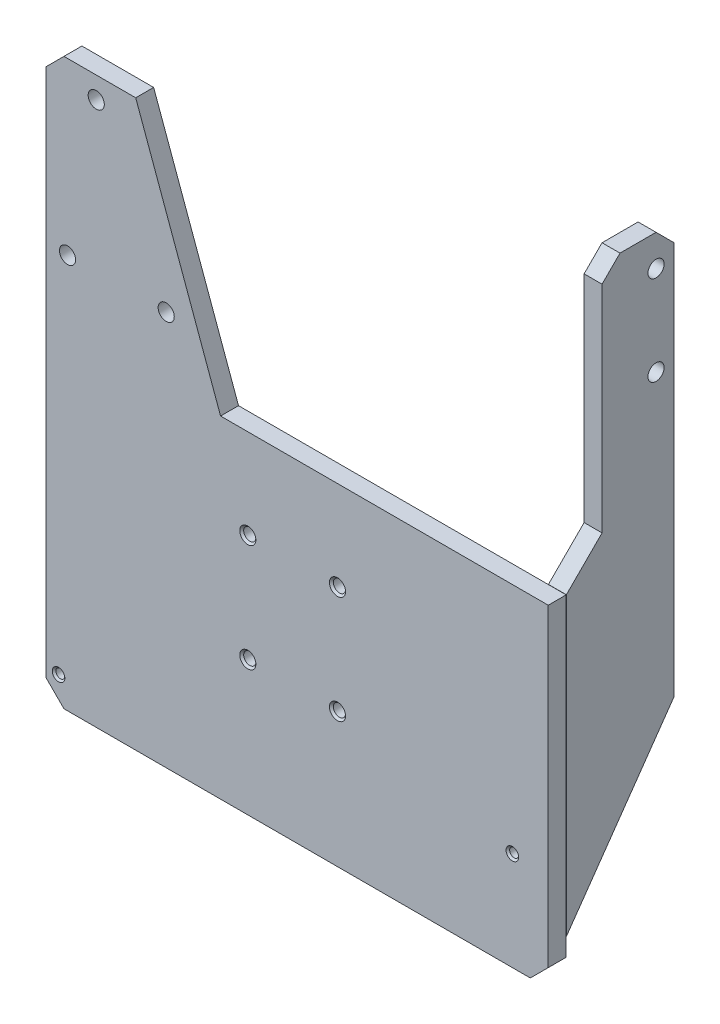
ISO-10303-21;
HEADER;
FILE_DESCRIPTION(('STEP AP214'),'2;1');
FILE_NAME('part.step','',(''),(''),'','','');
FILE_SCHEMA(('AUTOMOTIVE_DESIGN { 1 0 10303 214 1 1 1 1 }'));
ENDSEC;
DATA;
#1=APPLICATION_CONTEXT('core data for automotive mechanical design processes');
#2=APPLICATION_PROTOCOL_DEFINITION('international standard','automotive_design',2000,#1);
#3=PRODUCT_CONTEXT('',#1,'mechanical');
#4=PRODUCT('Part','Part','',(#3));
#5=PRODUCT_RELATED_PRODUCT_CATEGORY('part','',(#4));
#6=PRODUCT_DEFINITION_FORMATION('','',#4);
#7=PRODUCT_DEFINITION_CONTEXT('part definition',#1,'design');
#8=PRODUCT_DEFINITION('design','',#6,#7);
#9=PRODUCT_DEFINITION_SHAPE('','',#8);
#10=(LENGTH_UNIT() NAMED_UNIT(*) SI_UNIT(.MILLI.,.METRE.));
#11=(NAMED_UNIT(*) PLANE_ANGLE_UNIT() SI_UNIT($,.RADIAN.));
#12=(NAMED_UNIT(*) SI_UNIT($,.STERADIAN.) SOLID_ANGLE_UNIT());
#13=UNCERTAINTY_MEASURE_WITH_UNIT(LENGTH_MEASURE(1.E-05),#10,'distance_accuracy_value','');
#14=(GEOMETRIC_REPRESENTATION_CONTEXT(3) GLOBAL_UNCERTAINTY_ASSIGNED_CONTEXT((#13)) GLOBAL_UNIT_ASSIGNED_CONTEXT((#10,
#11,#12)) REPRESENTATION_CONTEXT('',''));
#15=CARTESIAN_POINT('',(0.,0.,0.));
#16=DIRECTION('',(0.,0.,1.));
#17=DIRECTION('',(1.,0.,0.));
#18=AXIS2_PLACEMENT_3D('',#15,#16,#17);
#19=CARTESIAN_POINT('',(125.,-25.,-0.10000000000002));
#20=DIRECTION('',(0.,-0.573576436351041,-0.819152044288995));
#21=DIRECTION('',(0.,0.819152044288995,-0.573576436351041));
#22=AXIS2_PLACEMENT_3D('',#19,#20,#21);
#23=PLANE('',#22);
#24=DIRECTION('',(0.,0.819152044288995,-0.573576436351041));
#25=VECTOR('',#24,1.);
#26=CARTESIAN_POINT('',(135.,-25.,-0.10000000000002));
#27=LINE('',#26,#25);
#28=CARTESIAN_POINT('',(135.,-25.,-0.10000000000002));
#29=VERTEX_POINT('',#28);
#30=CARTESIAN_POINT('',(135.,60.6888804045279,-60.1));
#31=VERTEX_POINT('',#30);
#32=EDGE_CURVE('E106',#29,#31,#27,.T.);
#33=ORIENTED_EDGE('',*,*,#32,.F.);
#34=DIRECTION('',(1.,0.,0.));
#35=VECTOR('',#34,1.);
#36=CARTESIAN_POINT('',(125.,-25.,-0.10000000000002));
#37=LINE('',#36,#35);
#38=CARTESIAN_POINT('',(125.,-25.,-0.10000000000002));
#39=VERTEX_POINT('',#38);
#40=EDGE_CURVE('E12',#39,#29,#37,.T.);
#41=ORIENTED_EDGE('',*,*,#40,.F.);
#42=DIRECTION('',(0.,0.819152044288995,-0.573576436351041));
#43=VECTOR('',#42,1.);
#44=CARTESIAN_POINT('',(125.,-25.,-0.10000000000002));
#45=LINE('',#44,#43);
#46=CARTESIAN_POINT('',(125.,60.6888804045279,-60.1));
#47=VERTEX_POINT('',#46);
#48=EDGE_CURVE('E108',#39,#47,#45,.T.);
#49=ORIENTED_EDGE('',*,*,#48,.T.);
#50=DIRECTION('',(1.,0.,0.));
#51=VECTOR('',#50,1.);
#52=CARTESIAN_POINT('',(125.,60.6888804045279,-60.1));
#53=LINE('',#52,#51);
#54=EDGE_CURVE('E45',#47,#31,#53,.T.);
#55=ORIENTED_EDGE('',*,*,#54,.T.);
#56=EDGE_LOOP('',(#33,#41,#49,#55));
#57=FACE_BOUND('',#56,.T.);
#58=ADVANCED_FACE('F42',(#57),#23,.T.);
#59=CARTESIAN_POINT('',(125.,140.,-0.1));
#60=DIRECTION('',(0.,0.,1.));
#61=DIRECTION('',(0.,-1.,0.));
#62=AXIS2_PLACEMENT_3D('',#59,#60,#61);
#63=PLANE('',#62);
#64=DIRECTION('',(0.,-1.,0.));
#65=VECTOR('',#64,1.);
#66=CARTESIAN_POINT('',(135.,140.,-0.1));
#67=LINE('',#66,#65);
#68=CARTESIAN_POINT('',(135.,140.,-0.1));
#69=VERTEX_POINT('',#68);
#70=EDGE_CURVE('E124',#69,#29,#67,.T.);
#71=ORIENTED_EDGE('',*,*,#70,.F.);
#72=DIRECTION('',(1.,0.,0.));
#73=VECTOR('',#72,1.);
#74=CARTESIAN_POINT('',(125.,140.,-0.1));
#75=LINE('',#74,#73);
#76=CARTESIAN_POINT('',(125.,140.,-0.1));
#77=VERTEX_POINT('',#76);
#78=EDGE_CURVE('E50',#77,#69,#75,.T.);
#79=ORIENTED_EDGE('',*,*,#78,.F.);
#80=DIRECTION('',(0.,-1.,0.));
#81=VECTOR('',#80,1.);
#82=CARTESIAN_POINT('',(125.,140.,-0.1));
#83=LINE('',#82,#81);
#84=EDGE_CURVE('E113',#77,#39,#83,.T.);
#85=ORIENTED_EDGE('',*,*,#84,.T.);
#86=ORIENTED_EDGE('',*,*,#40,.T.);
#87=EDGE_LOOP('',(#71,#79,#85,#86));
#88=FACE_BOUND('',#87,.T.);
#89=ADVANCED_FACE('F190',(#88),#63,.T.);
#90=CARTESIAN_POINT('',(125.,140.,-0.1));
#91=DIRECTION('',(0.,0.707106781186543,0.707106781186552));
#92=DIRECTION('',(0.,-0.707106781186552,0.707106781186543));
#93=AXIS2_PLACEMENT_3D('',#90,#91,#92);
#94=PLANE('',#93);
#95=DIRECTION('',(0.,-0.707106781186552,0.707106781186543));
#96=VECTOR('',#95,1.);
#97=CARTESIAN_POINT('',(135.,140.,-0.1));
#98=LINE('',#97,#96);
#99=CARTESIAN_POINT('',(135.,159.9,-20.));
#100=VERTEX_POINT('',#99);
#101=EDGE_CURVE('E142',#100,#69,#98,.T.);
#102=ORIENTED_EDGE('',*,*,#101,.F.);
#103=DIRECTION('',(1.,0.,0.));
#104=VECTOR('',#103,1.);
#105=CARTESIAN_POINT('',(125.,159.9,-20.));
#106=LINE('',#105,#104);
#107=CARTESIAN_POINT('',(125.,159.9,-20.));
#108=VERTEX_POINT('',#107);
#109=EDGE_CURVE('E164',#108,#100,#106,.T.);
#110=ORIENTED_EDGE('',*,*,#109,.F.);
#111=DIRECTION('',(0.,-0.707106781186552,0.707106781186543));
#112=VECTOR('',#111,1.);
#113=CARTESIAN_POINT('',(125.,140.,-0.1));
#114=LINE('',#113,#112);
#115=EDGE_CURVE('E160',#108,#77,#114,.T.);
#116=ORIENTED_EDGE('',*,*,#115,.T.);
#117=ORIENTED_EDGE('',*,*,#78,.T.);
#118=EDGE_LOOP('',(#102,#110,#116,#117));
#119=FACE_BOUND('',#118,.T.);
#120=ADVANCED_FACE('F189',(#119),#94,.T.);
#121=CARTESIAN_POINT('',(125.,280.,-20.));
#122=DIRECTION('',(0.,0.,1.));
#123=DIRECTION('',(0.,-1.,0.));
#124=AXIS2_PLACEMENT_3D('',#121,#122,#123);
#125=PLANE('',#124);
#126=DIRECTION('',(0.,-1.,0.));
#127=VECTOR('',#126,1.);
#128=CARTESIAN_POINT('',(135.,280.,-20.));
#129=LINE('',#128,#127);
#130=CARTESIAN_POINT('',(135.,280.,-20.));
#131=VERTEX_POINT('',#130);
#132=EDGE_CURVE('E139',#131,#100,#129,.T.);
#133=ORIENTED_EDGE('',*,*,#132,.F.);
#134=DIRECTION('',(1.,0.,0.));
#135=VECTOR('',#134,1.);
#136=CARTESIAN_POINT('',(125.,280.,-20.));
#137=LINE('',#136,#135);
#138=CARTESIAN_POINT('',(125.,280.,-20.));
#139=VERTEX_POINT('',#138);
#140=EDGE_CURVE('E166',#139,#131,#137,.T.);
#141=ORIENTED_EDGE('',*,*,#140,.F.);
#142=DIRECTION('',(0.,-1.,0.));
#143=VECTOR('',#142,1.);
#144=CARTESIAN_POINT('',(125.,280.,-20.));
#145=LINE('',#144,#143);
#146=EDGE_CURVE('E157',#139,#108,#145,.T.);
#147=ORIENTED_EDGE('',*,*,#146,.T.);
#148=ORIENTED_EDGE('',*,*,#109,.T.);
#149=EDGE_LOOP('',(#133,#141,#147,#148));
#150=FACE_BOUND('',#149,.T.);
#151=ADVANCED_FACE('F185',(#150),#125,.T.);
#152=CARTESIAN_POINT('',(125.,290.,-30.));
#153=DIRECTION('',(0.,0.707106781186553,0.707106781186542));
#154=DIRECTION('',(0.,-0.707106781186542,0.707106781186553));
#155=AXIS2_PLACEMENT_3D('',#152,#153,#154);
#156=PLANE('',#155);
#157=DIRECTION('',(0.,-0.707106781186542,0.707106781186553));
#158=VECTOR('',#157,1.);
#159=CARTESIAN_POINT('',(135.,290.,-30.));
#160=LINE('',#159,#158);
#161=CARTESIAN_POINT('',(135.,290.,-30.));
#162=VERTEX_POINT('',#161);
#163=EDGE_CURVE('E136',#162,#131,#160,.T.);
#164=ORIENTED_EDGE('',*,*,#163,.F.);
#165=DIRECTION('',(1.,0.,0.));
#166=VECTOR('',#165,1.);
#167=CARTESIAN_POINT('',(125.,290.,-30.));
#168=LINE('',#167,#166);
#169=CARTESIAN_POINT('',(125.,290.,-30.));
#170=VERTEX_POINT('',#169);
#171=EDGE_CURVE('E168',#170,#162,#168,.T.);
#172=ORIENTED_EDGE('',*,*,#171,.F.);
#173=DIRECTION('',(0.,-0.707106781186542,0.707106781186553));
#174=VECTOR('',#173,1.);
#175=CARTESIAN_POINT('',(125.,290.,-30.));
#176=LINE('',#175,#174);
#177=EDGE_CURVE('E154',#170,#139,#176,.T.);
#178=ORIENTED_EDGE('',*,*,#177,.T.);
#179=ORIENTED_EDGE('',*,*,#140,.T.);
#180=EDGE_LOOP('',(#164,#172,#178,#179));
#181=FACE_BOUND('',#180,.T.);
#182=ADVANCED_FACE('F181',(#181),#156,.T.);
#183=CARTESIAN_POINT('',(125.,290.,-30.));
#184=DIRECTION('',(0.,1.,0.));
#185=DIRECTION('',(-1.,0.,0.));
#186=AXIS2_PLACEMENT_3D('',#183,#184,#185);
#187=PLANE('',#186);
#188=DIRECTION('',(0.,0.,1.));
#189=VECTOR('',#188,1.);
#190=CARTESIAN_POINT('',(135.,290.,-30.));
#191=LINE('',#190,#189);
#192=CARTESIAN_POINT('',(135.,290.,-50.1));
#193=VERTEX_POINT('',#192);
#194=EDGE_CURVE('E133',#193,#162,#191,.T.);
#195=ORIENTED_EDGE('',*,*,#194,.F.);
#196=DIRECTION('',(1.,0.,0.));
#197=VECTOR('',#196,1.);
#198=CARTESIAN_POINT('',(125.,290.,-50.1));
#199=LINE('',#198,#197);
#200=CARTESIAN_POINT('',(125.,290.,-50.1));
#201=VERTEX_POINT('',#200);
#202=EDGE_CURVE('E170',#201,#193,#199,.T.);
#203=ORIENTED_EDGE('',*,*,#202,.F.);
#204=DIRECTION('',(0.,0.,1.));
#205=VECTOR('',#204,1.);
#206=CARTESIAN_POINT('',(125.,290.,-30.));
#207=LINE('',#206,#205);
#208=EDGE_CURVE('E151',#201,#170,#207,.T.);
#209=ORIENTED_EDGE('',*,*,#208,.T.);
#210=ORIENTED_EDGE('',*,*,#171,.T.);
#211=EDGE_LOOP('',(#195,#203,#209,#210));
#212=FACE_BOUND('',#211,.T.);
#213=ADVANCED_FACE('F177',(#212),#187,.T.);
#214=CARTESIAN_POINT('',(125.,290.,-50.1));
#215=DIRECTION('',(0.,0.707106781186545,-0.70710678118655));
#216=DIRECTION('',(0.,0.70710678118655,0.707106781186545));
#217=AXIS2_PLACEMENT_3D('',#214,#215,#216);
#218=PLANE('',#217);
#219=DIRECTION('',(0.,0.70710678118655,0.707106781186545));
#220=VECTOR('',#219,1.);
#221=CARTESIAN_POINT('',(135.,290.,-50.1));
#222=LINE('',#221,#220);
#223=CARTESIAN_POINT('',(135.,280.,-60.1));
#224=VERTEX_POINT('',#223);
#225=EDGE_CURVE('E120',#224,#193,#222,.T.);
#226=ORIENTED_EDGE('',*,*,#225,.F.);
#227=DIRECTION('',(1.,0.,0.));
#228=VECTOR('',#227,1.);
#229=CARTESIAN_POINT('',(125.,280.,-60.1));
#230=LINE('',#229,#228);
#231=CARTESIAN_POINT('',(125.,280.,-60.1));
#232=VERTEX_POINT('',#231);
#233=EDGE_CURVE('E112',#232,#224,#230,.T.);
#234=ORIENTED_EDGE('',*,*,#233,.F.);
#235=DIRECTION('',(0.,0.70710678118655,0.707106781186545));
#236=VECTOR('',#235,1.);
#237=CARTESIAN_POINT('',(125.,290.,-50.1));
#238=LINE('',#237,#236);
#239=EDGE_CURVE('E148',#232,#201,#238,.T.);
#240=ORIENTED_EDGE('',*,*,#239,.T.);
#241=ORIENTED_EDGE('',*,*,#202,.T.);
#242=EDGE_LOOP('',(#226,#234,#240,#241));
#243=FACE_BOUND('',#242,.T.);
#244=ADVANCED_FACE('F173',(#243),#218,.T.);
#245=CARTESIAN_POINT('',(125.,280.,-60.1));
#246=DIRECTION('',(0.,0.,-1.));
#247=DIRECTION('',(0.,1.,0.));
#248=AXIS2_PLACEMENT_3D('',#245,#246,#247);
#249=PLANE('',#248);
#250=DIRECTION('',(0.,1.,0.));
#251=VECTOR('',#250,1.);
#252=CARTESIAN_POINT('',(135.,280.,-60.1));
#253=LINE('',#252,#251);
#254=EDGE_CURVE('E115',#31,#224,#253,.T.);
#255=ORIENTED_EDGE('',*,*,#254,.F.);
#256=ORIENTED_EDGE('',*,*,#54,.F.);
#257=DIRECTION('',(0.,1.,0.));
#258=VECTOR('',#257,1.);
#259=CARTESIAN_POINT('',(125.,280.,-60.1));
#260=LINE('',#259,#258);
#261=EDGE_CURVE('E146',#47,#232,#260,.T.);
#262=ORIENTED_EDGE('',*,*,#261,.T.);
#263=ORIENTED_EDGE('',*,*,#233,.T.);
#264=EDGE_LOOP('',(#255,#256,#262,#263));
#265=FACE_BOUND('',#264,.T.);
#266=ADVANCED_FACE('F116',(#265),#249,.T.);
#267=CARTESIAN_POINT('',(125.,189.679673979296,-150.420326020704));
#268=DIRECTION('',(-1.,0.,0.));
#269=DIRECTION('',(0.,0.,1.));
#270=AXIS2_PLACEMENT_3D('',#267,#268,#269);
#271=PLANE('',#270);
#272=CARTESIAN_POINT('',(125.,222.5,-50.1));
#273=DIRECTION('',(-1.,0.,0.));
#274=DIRECTION('',(0.,0.,1.));
#275=AXIS2_PLACEMENT_3D('',#272,#273,#274);
#276=CIRCLE('',#275,4.5);
#277=CARTESIAN_POINT('',(125.,222.5,-45.6));
#278=VERTEX_POINT('',#277);
#279=EDGE_CURVE('E266',#278,#278,#276,.T.);
#280=ORIENTED_EDGE('',*,*,#279,.F.);
#281=EDGE_LOOP('',(#280));
#282=FACE_BOUND('',#281,.T.);
#283=CARTESIAN_POINT('',(125.,272.5,-50.1));
#284=DIRECTION('',(-1.,0.,0.));
#285=DIRECTION('',(0.,0.,1.));
#286=AXIS2_PLACEMENT_3D('',#283,#284,#285);
#287=CIRCLE('',#286,4.5);
#288=CARTESIAN_POINT('',(125.,272.5,-45.6));
#289=VERTEX_POINT('',#288);
#290=EDGE_CURVE('E125',#289,#289,#287,.T.);
#291=ORIENTED_EDGE('',*,*,#290,.F.);
#292=EDGE_LOOP('',(#291));
#293=FACE_BOUND('',#292,.T.);
#294=ORIENTED_EDGE('',*,*,#48,.F.);
#295=ORIENTED_EDGE('',*,*,#84,.F.);
#296=ORIENTED_EDGE('',*,*,#115,.F.);
#297=ORIENTED_EDGE('',*,*,#146,.F.);
#298=ORIENTED_EDGE('',*,*,#177,.F.);
#299=ORIENTED_EDGE('',*,*,#208,.F.);
#300=ORIENTED_EDGE('',*,*,#239,.F.);
#301=ORIENTED_EDGE('',*,*,#261,.F.);
#302=EDGE_LOOP('',(#294,#295,#296,#297,#298,#299,#300,#301));
#303=FACE_BOUND('',#302,.T.);
#304=ADVANCED_FACE('F193',(#282,#293,#303),#271,.T.);
#305=CARTESIAN_POINT('',(135.,189.679673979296,-150.420326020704));
#306=DIRECTION('',(-1.,0.,0.));
#307=DIRECTION('',(0.,0.,1.));
#308=AXIS2_PLACEMENT_3D('',#305,#306,#307);
#309=PLANE('',#308);
#310=CARTESIAN_POINT('',(135.,222.5,-50.1));
#311=DIRECTION('',(1.,0.,0.));
#312=DIRECTION('',(0.,0.,-1.));
#313=AXIS2_PLACEMENT_3D('',#310,#311,#312);
#314=CIRCLE('',#313,4.5);
#315=CARTESIAN_POINT('',(135.,222.5,-54.6));
#316=VERTEX_POINT('',#315);
#317=EDGE_CURVE('E269',#316,#316,#314,.T.);
#318=ORIENTED_EDGE('',*,*,#317,.F.);
#319=EDGE_LOOP('',(#318));
#320=FACE_BOUND('',#319,.T.);
#321=CARTESIAN_POINT('',(135.,272.5,-50.1));
#322=DIRECTION('',(1.,0.,0.));
#323=DIRECTION('',(0.,0.,-1.));
#324=AXIS2_PLACEMENT_3D('',#321,#322,#323);
#325=CIRCLE('',#324,4.5);
#326=CARTESIAN_POINT('',(135.,272.5,-54.6));
#327=VERTEX_POINT('',#326);
#328=EDGE_CURVE('E128',#327,#327,#325,.T.);
#329=ORIENTED_EDGE('',*,*,#328,.F.);
#330=EDGE_LOOP('',(#329));
#331=FACE_BOUND('',#330,.T.);
#332=ORIENTED_EDGE('',*,*,#32,.T.);
#333=ORIENTED_EDGE('',*,*,#254,.T.);
#334=ORIENTED_EDGE('',*,*,#225,.T.);
#335=ORIENTED_EDGE('',*,*,#194,.T.);
#336=ORIENTED_EDGE('',*,*,#163,.T.);
#337=ORIENTED_EDGE('',*,*,#132,.T.);
#338=ORIENTED_EDGE('',*,*,#101,.T.);
#339=ORIENTED_EDGE('',*,*,#70,.T.);
#340=EDGE_LOOP('',(#332,#333,#334,#335,#336,#337,#338,#339));
#341=FACE_BOUND('',#340,.T.);
#342=ADVANCED_FACE('F122',(#320,#331,#341),#309,.F.);
#343=CARTESIAN_POINT('',(-145.,272.5,-50.1));
#344=DIRECTION('',(1.,0.,0.));
#345=DIRECTION('',(0.,0.,-1.));
#346=AXIS2_PLACEMENT_3D('',#343,#344,#345);
#347=CYLINDRICAL_SURFACE('',#346,4.5);
#348=ORIENTED_EDGE('',*,*,#290,.T.);
#349=EDGE_LOOP('',(#348));
#350=FACE_BOUND('',#349,.T.);
#351=ORIENTED_EDGE('',*,*,#328,.T.);
#352=EDGE_LOOP('',(#351));
#353=FACE_BOUND('',#352,.T.);
#354=ADVANCED_FACE('F201',(#350,#353),#347,.F.);
#355=CARTESIAN_POINT('',(-145.,222.5,-50.1));
#356=DIRECTION('',(1.,0.,0.));
#357=DIRECTION('',(0.,0.,-1.));
#358=AXIS2_PLACEMENT_3D('',#355,#356,#357);
#359=CYLINDRICAL_SURFACE('',#358,4.5);
#360=ORIENTED_EDGE('',*,*,#279,.T.);
#361=EDGE_LOOP('',(#360));
#362=FACE_BOUND('',#361,.T.);
#363=ORIENTED_EDGE('',*,*,#317,.T.);
#364=EDGE_LOOP('',(#363));
#365=FACE_BOUND('',#364,.T.);
#366=ADVANCED_FACE('F250',(#362,#365),#359,.F.);
#367=CLOSED_SHELL('',(#58,#89,#120,#151,#182,#213,#244,#266,#304,#342,#354,#366));
#368=MANIFOLD_SOLID_BREP('B2',#367);
#369=CARTESIAN_POINT('',(135.,140.,10.));
#370=DIRECTION('',(-1.,0.,0.));
#371=DIRECTION('',(0.,-1.,0.));
#372=AXIS2_PLACEMENT_3D('',#369,#370,#371);
#373=PLANE('',#372);
#374=DIRECTION('',(0.,1.,0.));
#375=VECTOR('',#374,1.);
#376=CARTESIAN_POINT('',(135.,140.,10.));
#377=LINE('',#376,#375);
#378=CARTESIAN_POINT('',(135.,-34.9999999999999,10.));
#379=VERTEX_POINT('',#378);
#380=CARTESIAN_POINT('',(135.,140.,10.));
#381=VERTEX_POINT('',#380);
#382=EDGE_CURVE('E509',#379,#381,#377,.T.);
#383=ORIENTED_EDGE('',*,*,#382,.F.);
#384=DIRECTION('',(0.,0.,-1.));
#385=VECTOR('',#384,1.);
#386=CARTESIAN_POINT('',(135.,-34.9999999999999,10.));
#387=LINE('',#386,#385);
#388=CARTESIAN_POINT('',(135.,-34.9999999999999,0.));
#389=VERTEX_POINT('',#388);
#390=EDGE_CURVE('E390',#379,#389,#387,.T.);
#391=ORIENTED_EDGE('',*,*,#390,.T.);
#392=DIRECTION('',(0.,1.,0.));
#393=VECTOR('',#392,1.);
#394=CARTESIAN_POINT('',(135.,140.,0.));
#395=LINE('',#394,#393);
#396=CARTESIAN_POINT('',(135.,140.,0.));
#397=VERTEX_POINT('',#396);
#398=EDGE_CURVE('E384',#389,#397,#395,.T.);
#399=ORIENTED_EDGE('',*,*,#398,.T.);
#400=DIRECTION('',(0.,0.,-1.));
#401=VECTOR('',#400,1.);
#402=CARTESIAN_POINT('',(135.,140.,10.));
#403=LINE('',#402,#401);
#404=EDGE_CURVE('E388',#381,#397,#403,.T.);
#405=ORIENTED_EDGE('',*,*,#404,.F.);
#406=EDGE_LOOP('',(#383,#391,#399,#405));
#407=FACE_BOUND('',#406,.T.);
#408=ADVANCED_FACE('F311',(#407),#373,.F.);
#409=CARTESIAN_POINT('',(-47.6838695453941,140.,10.));
#410=DIRECTION('',(0.,-1.,0.));
#411=DIRECTION('',(0.,0.,-1.));
#412=AXIS2_PLACEMENT_3D('',#409,#410,#411);
#413=PLANE('',#412);
#414=DIRECTION('',(-1.,0.,0.));
#415=VECTOR('',#414,1.);
#416=CARTESIAN_POINT('',(-47.6838695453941,140.,0.));
#417=LINE('',#416,#415);
#418=CARTESIAN_POINT('',(-47.6838695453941,140.,0.));
#419=VERTEX_POINT('',#418);
#420=EDGE_CURVE('E392',#397,#419,#417,.T.);
#421=ORIENTED_EDGE('',*,*,#420,.T.);
#422=DIRECTION('',(0.,0.,-1.));
#423=VECTOR('',#422,1.);
#424=CARTESIAN_POINT('',(-47.6838695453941,140.,10.));
#425=LINE('',#424,#423);
#426=CARTESIAN_POINT('',(-47.6838695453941,140.,10.));
#427=VERTEX_POINT('',#426);
#428=EDGE_CURVE('E408',#427,#419,#425,.T.);
#429=ORIENTED_EDGE('',*,*,#428,.F.);
#430=DIRECTION('',(-1.,0.,0.));
#431=VECTOR('',#430,1.);
#432=CARTESIAN_POINT('',(-47.6838695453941,140.,10.));
#433=LINE('',#432,#431);
#434=EDGE_CURVE('E406',#381,#427,#433,.T.);
#435=ORIENTED_EDGE('',*,*,#434,.F.);
#436=ORIENTED_EDGE('',*,*,#404,.T.);
#437=EDGE_LOOP('',(#421,#429,#435,#436));
#438=FACE_BOUND('',#437,.T.);
#439=ADVANCED_FACE('F405',(#438),#413,.F.);
#440=CARTESIAN_POINT('',(-95.,270.,10.));
#441=DIRECTION('',(-0.939692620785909,-0.342020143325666,0.));
#442=DIRECTION('',(0.342020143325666,-0.93969262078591,0.));
#443=AXIS2_PLACEMENT_3D('',#440,#441,#442);
#444=PLANE('',#443);
#445=DIRECTION('',(-0.342020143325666,0.939692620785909,0.));
#446=VECTOR('',#445,1.);
#447=CARTESIAN_POINT('',(-95.,270.,0.));
#448=LINE('',#447,#446);
#449=CARTESIAN_POINT('',(-95.,270.,0.));
#450=VERTEX_POINT('',#449);
#451=EDGE_CURVE('E399',#419,#450,#448,.T.);
#452=ORIENTED_EDGE('',*,*,#451,.T.);
#453=DIRECTION('',(0.,0.,-1.));
#454=VECTOR('',#453,1.);
#455=CARTESIAN_POINT('',(-95.,270.,10.));
#456=LINE('',#455,#454);
#457=CARTESIAN_POINT('',(-95.,270.,10.));
#458=VERTEX_POINT('',#457);
#459=EDGE_CURVE('E412',#458,#450,#456,.T.);
#460=ORIENTED_EDGE('',*,*,#459,.F.);
#461=DIRECTION('',(-0.342020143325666,0.939692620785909,0.));
#462=VECTOR('',#461,1.);
#463=CARTESIAN_POINT('',(-95.,270.,10.));
#464=LINE('',#463,#462);
#465=EDGE_CURVE('E512',#427,#458,#464,.T.);
#466=ORIENTED_EDGE('',*,*,#465,.F.);
#467=ORIENTED_EDGE('',*,*,#428,.T.);
#468=EDGE_LOOP('',(#452,#460,#466,#467));
#469=FACE_BOUND('',#468,.T.);
#470=ADVANCED_FACE('F545',(#469),#444,.F.);
#471=CARTESIAN_POINT('',(-145.,270.,10.));
#472=DIRECTION('',(0.,-1.,0.));
#473=DIRECTION('',(0.,0.,-1.));
#474=AXIS2_PLACEMENT_3D('',#471,#472,#473);
#475=PLANE('',#474);
#476=DIRECTION('',(-1.,0.,0.));
#477=VECTOR('',#476,1.);
#478=CARTESIAN_POINT('',(-145.,270.,0.));
#479=LINE('',#478,#477);
#480=CARTESIAN_POINT('',(-135.,270.,0.));
#481=VERTEX_POINT('',#480);
#482=EDGE_CURVE('E501',#450,#481,#479,.T.);
#483=ORIENTED_EDGE('',*,*,#482,.T.);
#484=DIRECTION('',(0.,0.,1.));
#485=VECTOR('',#484,1.);
#486=CARTESIAN_POINT('',(-135.,270.,10.));
#487=LINE('',#486,#485);
#488=CARTESIAN_POINT('',(-135.,270.,10.));
#489=VERTEX_POINT('',#488);
#490=EDGE_CURVE('E424',#481,#489,#487,.T.);
#491=ORIENTED_EDGE('',*,*,#490,.T.);
#492=DIRECTION('',(-1.,0.,0.));
#493=VECTOR('',#492,1.);
#494=CARTESIAN_POINT('',(-145.,270.,10.));
#495=LINE('',#494,#493);
#496=EDGE_CURVE('E514',#458,#489,#495,.T.);
#497=ORIENTED_EDGE('',*,*,#496,.F.);
#498=ORIENTED_EDGE('',*,*,#459,.T.);
#499=EDGE_LOOP('',(#483,#491,#497,#498));
#500=FACE_BOUND('',#499,.T.);
#501=ADVANCED_FACE('F524',(#500),#475,.F.);
#502=CARTESIAN_POINT('',(-145.,-45.,10.));
#503=DIRECTION('',(1.,0.,0.));
#504=DIRECTION('',(0.,1.,0.));
#505=AXIS2_PLACEMENT_3D('',#502,#503,#504);
#506=PLANE('',#505);
#507=DIRECTION('',(0.,-1.,0.));
#508=VECTOR('',#507,1.);
#509=CARTESIAN_POINT('',(-145.,-45.,10.));
#510=LINE('',#509,#508);
#511=CARTESIAN_POINT('',(-145.,260.,10.));
#512=VERTEX_POINT('',#511);
#513=CARTESIAN_POINT('',(-145.,-35.,10.));
#514=VERTEX_POINT('',#513);
#515=EDGE_CURVE('E517',#512,#514,#510,.T.);
#516=ORIENTED_EDGE('',*,*,#515,.F.);
#517=DIRECTION('',(0.,0.,-1.));
#518=VECTOR('',#517,1.);
#519=CARTESIAN_POINT('',(-145.,260.,10.));
#520=LINE('',#519,#518);
#521=CARTESIAN_POINT('',(-145.,260.,0.));
#522=VERTEX_POINT('',#521);
#523=EDGE_CURVE('E410',#512,#522,#520,.T.);
#524=ORIENTED_EDGE('',*,*,#523,.T.);
#525=DIRECTION('',(0.,-1.,0.));
#526=VECTOR('',#525,1.);
#527=CARTESIAN_POINT('',(-145.,-45.,0.));
#528=LINE('',#527,#526);
#529=CARTESIAN_POINT('',(-145.,-35.,0.));
#530=VERTEX_POINT('',#529);
#531=EDGE_CURVE('E504',#522,#530,#528,.T.);
#532=ORIENTED_EDGE('',*,*,#531,.T.);
#533=DIRECTION('',(0.,0.,1.));
#534=VECTOR('',#533,1.);
#535=CARTESIAN_POINT('',(-145.,-35.,10.));
#536=LINE('',#535,#534);
#537=EDGE_CURVE('E407',#530,#514,#536,.T.);
#538=ORIENTED_EDGE('',*,*,#537,.T.);
#539=EDGE_LOOP('',(#516,#524,#532,#538));
#540=FACE_BOUND('',#539,.T.);
#541=ADVANCED_FACE('F534',(#540),#506,.F.);
#542=CARTESIAN_POINT('',(135.,-45.,10.));
#543=DIRECTION('',(0.,1.,0.));
#544=DIRECTION('',(-1.,0.,0.));
#545=AXIS2_PLACEMENT_3D('',#542,#543,#544);
#546=PLANE('',#545);
#547=DIRECTION('',(1.,0.,0.));
#548=VECTOR('',#547,1.);
#549=CARTESIAN_POINT('',(135.,-45.,0.));
#550=LINE('',#549,#548);
#551=CARTESIAN_POINT('',(-135.,-45.,0.));
#552=VERTEX_POINT('',#551);
#553=CARTESIAN_POINT('',(125.,-45.,0.));
#554=VERTEX_POINT('',#553);
#555=EDGE_CURVE('E507',#552,#554,#550,.T.);
#556=ORIENTED_EDGE('',*,*,#555,.T.);
#557=DIRECTION('',(0.,0.,1.));
#558=VECTOR('',#557,1.);
#559=CARTESIAN_POINT('',(125.,-45.,10.));
#560=LINE('',#559,#558);
#561=CARTESIAN_POINT('',(125.,-45.,10.));
#562=VERTEX_POINT('',#561);
#563=EDGE_CURVE('E40',#554,#562,#560,.T.);
#564=ORIENTED_EDGE('',*,*,#563,.T.);
#565=DIRECTION('',(1.,0.,0.));
#566=VECTOR('',#565,1.);
#567=CARTESIAN_POINT('',(135.,-45.,10.));
#568=LINE('',#567,#566);
#569=CARTESIAN_POINT('',(-135.,-45.,10.));
#570=VERTEX_POINT('',#569);
#571=EDGE_CURVE('E519',#570,#562,#568,.T.);
#572=ORIENTED_EDGE('',*,*,#571,.F.);
#573=DIRECTION('',(0.,0.,-1.));
#574=VECTOR('',#573,1.);
#575=CARTESIAN_POINT('',(-135.,-45.,10.));
#576=LINE('',#575,#574);
#577=EDGE_CURVE('E319',#570,#552,#576,.T.);
#578=ORIENTED_EDGE('',*,*,#577,.T.);
#579=EDGE_LOOP('',(#556,#564,#572,#578));
#580=FACE_BOUND('',#579,.T.);
#581=ADVANCED_FACE('F541',(#580),#546,.F.);
#582=CARTESIAN_POINT('',(135.,-45.,10.));
#583=DIRECTION('',(0.,0.,-1.));
#584=DIRECTION('',(-1.,0.,0.));
#585=AXIS2_PLACEMENT_3D('',#582,#583,#584);
#586=PLANE('',#585);
#587=CARTESIAN_POINT('',(-32.5,90.,10.));
#588=DIRECTION('',(0.,0.,1.));
#589=DIRECTION('',(1.,0.,0.));
#590=AXIS2_PLACEMENT_3D('',#587,#588,#589);
#591=CIRCLE('',#590,4.5);
#592=CARTESIAN_POINT('',(-28.,90.,10.));
#593=VERTEX_POINT('',#592);
#594=EDGE_CURVE('E787',#593,#593,#591,.T.);
#595=ORIENTED_EDGE('',*,*,#594,.F.);
#596=EDGE_LOOP('',(#595));
#597=FACE_BOUND('',#596,.T.);
#598=CARTESIAN_POINT('',(17.5,90.,10.));
#599=DIRECTION('',(0.,0.,1.));
#600=DIRECTION('',(1.,0.,0.));
#601=AXIS2_PLACEMENT_3D('',#598,#599,#600);
#602=CIRCLE('',#601,4.5);
#603=CARTESIAN_POINT('',(22.,90.,10.));
#604=VERTEX_POINT('',#603);
#605=EDGE_CURVE('E456',#604,#604,#602,.T.);
#606=ORIENTED_EDGE('',*,*,#605,.F.);
#607=EDGE_LOOP('',(#606));
#608=FACE_BOUND('',#607,.T.);
#609=CARTESIAN_POINT('',(-32.5,30.,10.));
#610=DIRECTION('',(0.,0.,1.));
#611=DIRECTION('',(1.,0.,0.));
#612=AXIS2_PLACEMENT_3D('',#609,#610,#611);
#613=CIRCLE('',#612,4.5);
#614=CARTESIAN_POINT('',(-28.,30.,10.));
#615=VERTEX_POINT('',#614);
#616=EDGE_CURVE('E452',#615,#615,#613,.T.);
#617=ORIENTED_EDGE('',*,*,#616,.F.);
#618=EDGE_LOOP('',(#617));
#619=FACE_BOUND('',#618,.T.);
#620=CARTESIAN_POINT('',(17.5,30.,10.));
#621=DIRECTION('',(0.,0.,1.));
#622=DIRECTION('',(1.,0.,0.));
#623=AXIS2_PLACEMENT_3D('',#620,#621,#622);
#624=CIRCLE('',#623,4.5);
#625=CARTESIAN_POINT('',(22.,30.,10.));
#626=VERTEX_POINT('',#625);
#627=EDGE_CURVE('E448',#626,#626,#624,.T.);
#628=ORIENTED_EDGE('',*,*,#627,.F.);
#629=EDGE_LOOP('',(#628));
#630=FACE_BOUND('',#629,.T.);
#631=CARTESIAN_POINT('',(-138.,-30.,10.));
#632=DIRECTION('',(0.,0.,1.));
#633=DIRECTION('',(1.,0.,0.));
#634=AXIS2_PLACEMENT_3D('',#631,#632,#633);
#635=CIRCLE('',#634,3.5);
#636=CARTESIAN_POINT('',(-134.5,-30.,10.));
#637=VERTEX_POINT('',#636);
#638=EDGE_CURVE('E443',#637,#637,#635,.T.);
#639=ORIENTED_EDGE('',*,*,#638,.F.);
#640=EDGE_LOOP('',(#639));
#641=FACE_BOUND('',#640,.T.);
#642=CARTESIAN_POINT('',(115.,10.,10.));
#643=DIRECTION('',(0.,0.,1.));
#644=DIRECTION('',(1.,0.,0.));
#645=AXIS2_PLACEMENT_3D('',#642,#643,#644);
#646=CIRCLE('',#645,3.5);
#647=CARTESIAN_POINT('',(118.5,10.,10.));
#648=VERTEX_POINT('',#647);
#649=EDGE_CURVE('E438',#648,#648,#646,.T.);
#650=ORIENTED_EDGE('',*,*,#649,.F.);
#651=EDGE_LOOP('',(#650));
#652=FACE_BOUND('',#651,.T.);
#653=CARTESIAN_POINT('',(-78.,175.,10.));
#654=DIRECTION('',(0.,0.,1.));
#655=DIRECTION('',(1.,0.,0.));
#656=AXIS2_PLACEMENT_3D('',#653,#654,#655);
#657=CIRCLE('',#656,4.50000000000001);
#658=CARTESIAN_POINT('',(-73.5,175.,10.));
#659=VERTEX_POINT('',#658);
#660=EDGE_CURVE('E437',#659,#659,#657,.T.);
#661=ORIENTED_EDGE('',*,*,#660,.F.);
#662=EDGE_LOOP('',(#661));
#663=FACE_BOUND('',#662,.T.);
#664=CARTESIAN_POINT('',(-133.,175.,10.));
#665=DIRECTION('',(0.,0.,1.));
#666=DIRECTION('',(1.,0.,0.));
#667=AXIS2_PLACEMENT_3D('',#664,#665,#666);
#668=CIRCLE('',#667,4.49999999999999);
#669=CARTESIAN_POINT('',(-128.5,175.,10.));
#670=VERTEX_POINT('',#669);
#671=EDGE_CURVE('E489',#670,#670,#668,.T.);
#672=ORIENTED_EDGE('',*,*,#671,.F.);
#673=EDGE_LOOP('',(#672));
#674=FACE_BOUND('',#673,.T.);
#675=CARTESIAN_POINT('',(-117.,258.,10.));
#676=DIRECTION('',(0.,0.,1.));
#677=DIRECTION('',(1.,0.,0.));
#678=AXIS2_PLACEMENT_3D('',#675,#676,#677);
#679=CIRCLE('',#678,4.50000000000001);
#680=CARTESIAN_POINT('',(-112.5,258.,10.));
#681=VERTEX_POINT('',#680);
#682=EDGE_CURVE('E495',#681,#681,#679,.T.);
#683=ORIENTED_EDGE('',*,*,#682,.F.);
#684=EDGE_LOOP('',(#683));
#685=FACE_BOUND('',#684,.T.);
#686=ORIENTED_EDGE('',*,*,#496,.T.);
#687=DIRECTION('',(0.707106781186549,0.707106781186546,0.));
#688=VECTOR('',#687,1.);
#689=CARTESIAN_POINT('',(-145.,260.,10.));
#690=LINE('',#689,#688);
#691=EDGE_CURVE('E429',#489,#512,#690,.F.);
#692=ORIENTED_EDGE('',*,*,#691,.T.);
#693=ORIENTED_EDGE('',*,*,#515,.T.);
#694=DIRECTION('',(-0.707106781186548,0.707106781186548,0.));
#695=VECTOR('',#694,1.);
#696=CARTESIAN_POINT('',(-135.,-45.,10.));
#697=LINE('',#696,#695);
#698=EDGE_CURVE('E332',#514,#570,#697,.F.);
#699=ORIENTED_EDGE('',*,*,#698,.T.);
#700=ORIENTED_EDGE('',*,*,#571,.T.);
#701=DIRECTION('',(-0.707106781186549,-0.707106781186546,0.));
#702=VECTOR('',#701,1.);
#703=CARTESIAN_POINT('',(135.,-34.9999999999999,10.));
#704=LINE('',#703,#702);
#705=EDGE_CURVE('E427',#562,#379,#704,.F.);
#706=ORIENTED_EDGE('',*,*,#705,.T.);
#707=ORIENTED_EDGE('',*,*,#382,.T.);
#708=ORIENTED_EDGE('',*,*,#434,.T.);
#709=ORIENTED_EDGE('',*,*,#465,.T.);
#710=EDGE_LOOP('',(#686,#692,#693,#699,#700,#706,#707,#708,#709));
#711=FACE_BOUND('',#710,.T.);
#712=ADVANCED_FACE('F536',(#597,#608,#619,#630,#641,#652,#663,#674,#685,#711),#586,.F.);
#713=CARTESIAN_POINT('',(135.,-45.,0.));
#714=DIRECTION('',(0.,0.,-1.));
#715=DIRECTION('',(-1.,0.,0.));
#716=AXIS2_PLACEMENT_3D('',#713,#714,#715);
#717=PLANE('',#716);
#718=CARTESIAN_POINT('',(-32.5,90.,0.));
#719=DIRECTION('',(0.,0.,-1.));
#720=DIRECTION('',(-1.,0.,0.));
#721=AXIS2_PLACEMENT_3D('',#718,#719,#720);
#722=CIRCLE('',#721,3.39999999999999);
#723=CARTESIAN_POINT('',(-35.9,90.,0.));
#724=VERTEX_POINT('',#723);
#725=EDGE_CURVE('E314',#724,#724,#722,.T.);
#726=ORIENTED_EDGE('',*,*,#725,.F.);
#727=EDGE_LOOP('',(#726));
#728=FACE_BOUND('',#727,.T.);
#729=CARTESIAN_POINT('',(17.5,90.,0.));
#730=DIRECTION('',(0.,0.,-1.));
#731=DIRECTION('',(-1.,0.,0.));
#732=AXIS2_PLACEMENT_3D('',#729,#730,#731);
#733=CIRCLE('',#732,3.39999999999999);
#734=CARTESIAN_POINT('',(14.1,90.,0.));
#735=VERTEX_POINT('',#734);
#736=EDGE_CURVE('E453',#735,#735,#733,.T.);
#737=ORIENTED_EDGE('',*,*,#736,.F.);
#738=EDGE_LOOP('',(#737));
#739=FACE_BOUND('',#738,.T.);
#740=CARTESIAN_POINT('',(-32.5,30.,0.));
#741=DIRECTION('',(0.,0.,-1.));
#742=DIRECTION('',(-1.,0.,0.));
#743=AXIS2_PLACEMENT_3D('',#740,#741,#742);
#744=CIRCLE('',#743,3.39999999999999);
#745=CARTESIAN_POINT('',(-35.9,30.,0.));
#746=VERTEX_POINT('',#745);
#747=EDGE_CURVE('E449',#746,#746,#744,.T.);
#748=ORIENTED_EDGE('',*,*,#747,.F.);
#749=EDGE_LOOP('',(#748));
#750=FACE_BOUND('',#749,.T.);
#751=CARTESIAN_POINT('',(17.5,30.,0.));
#752=DIRECTION('',(0.,0.,-1.));
#753=DIRECTION('',(-1.,0.,0.));
#754=AXIS2_PLACEMENT_3D('',#751,#752,#753);
#755=CIRCLE('',#754,3.39999999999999);
#756=CARTESIAN_POINT('',(14.1,30.,0.));
#757=VERTEX_POINT('',#756);
#758=EDGE_CURVE('E444',#757,#757,#755,.T.);
#759=ORIENTED_EDGE('',*,*,#758,.F.);
#760=EDGE_LOOP('',(#759));
#761=FACE_BOUND('',#760,.T.);
#762=CARTESIAN_POINT('',(-138.,-30.,0.));
#763=DIRECTION('',(0.,0.,-1.));
#764=DIRECTION('',(-1.,0.,0.));
#765=AXIS2_PLACEMENT_3D('',#762,#763,#764);
#766=CIRCLE('',#765,2.5);
#767=CARTESIAN_POINT('',(-140.5,-30.,0.));
#768=VERTEX_POINT('',#767);
#769=EDGE_CURVE('E439',#768,#768,#766,.T.);
#770=ORIENTED_EDGE('',*,*,#769,.F.);
#771=EDGE_LOOP('',(#770));
#772=FACE_BOUND('',#771,.T.);
#773=CARTESIAN_POINT('',(115.,10.,0.));
#774=DIRECTION('',(0.,0.,-1.));
#775=DIRECTION('',(-1.,0.,0.));
#776=AXIS2_PLACEMENT_3D('',#773,#774,#775);
#777=CIRCLE('',#776,2.5);
#778=CARTESIAN_POINT('',(112.5,10.,0.));
#779=VERTEX_POINT('',#778);
#780=EDGE_CURVE('E434',#779,#779,#777,.T.);
#781=ORIENTED_EDGE('',*,*,#780,.F.);
#782=EDGE_LOOP('',(#781));
#783=FACE_BOUND('',#782,.T.);
#784=CARTESIAN_POINT('',(-78.,175.,0.));
#785=DIRECTION('',(0.,0.,1.));
#786=DIRECTION('',(1.,0.,0.));
#787=AXIS2_PLACEMENT_3D('',#784,#785,#786);
#788=CIRCLE('',#787,4.50000000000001);
#789=CARTESIAN_POINT('',(-73.5,175.,0.));
#790=VERTEX_POINT('',#789);
#791=EDGE_CURVE('E486',#790,#790,#788,.T.);
#792=ORIENTED_EDGE('',*,*,#791,.T.);
#793=EDGE_LOOP('',(#792));
#794=FACE_BOUND('',#793,.T.);
#795=CARTESIAN_POINT('',(-133.,175.,0.));
#796=DIRECTION('',(0.,0.,1.));
#797=DIRECTION('',(1.,0.,0.));
#798=AXIS2_PLACEMENT_3D('',#795,#796,#797);
#799=CIRCLE('',#798,4.49999999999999);
#800=CARTESIAN_POINT('',(-128.5,175.,0.));
#801=VERTEX_POINT('',#800);
#802=EDGE_CURVE('E492',#801,#801,#799,.T.);
#803=ORIENTED_EDGE('',*,*,#802,.T.);
#804=EDGE_LOOP('',(#803));
#805=FACE_BOUND('',#804,.T.);
#806=CARTESIAN_POINT('',(-117.,258.,0.));
#807=DIRECTION('',(0.,0.,1.));
#808=DIRECTION('',(1.,0.,0.));
#809=AXIS2_PLACEMENT_3D('',#806,#807,#808);
#810=CIRCLE('',#809,4.50000000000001);
#811=CARTESIAN_POINT('',(-112.5,258.,0.));
#812=VERTEX_POINT('',#811);
#813=EDGE_CURVE('E393',#812,#812,#810,.T.);
#814=ORIENTED_EDGE('',*,*,#813,.T.);
#815=EDGE_LOOP('',(#814));
#816=FACE_BOUND('',#815,.T.);
#817=ORIENTED_EDGE('',*,*,#531,.F.);
#818=DIRECTION('',(-0.707106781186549,-0.707106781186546,0.));
#819=VECTOR('',#818,1.);
#820=CARTESIAN_POINT('',(-157.499999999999,247.500000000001,0.));
#821=LINE('',#820,#819);
#822=EDGE_CURVE('E422',#522,#481,#821,.F.);
#823=ORIENTED_EDGE('',*,*,#822,.T.);
#824=ORIENTED_EDGE('',*,*,#482,.F.);
#825=ORIENTED_EDGE('',*,*,#451,.F.);
#826=ORIENTED_EDGE('',*,*,#420,.F.);
#827=ORIENTED_EDGE('',*,*,#398,.F.);
#828=DIRECTION('',(0.707106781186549,0.707106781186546,0.));
#829=VECTOR('',#828,1.);
#830=CARTESIAN_POINT('',(130.,-39.9999999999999,0.));
#831=LINE('',#830,#829);
#832=EDGE_CURVE('E420',#389,#554,#831,.F.);
#833=ORIENTED_EDGE('',*,*,#832,.T.);
#834=ORIENTED_EDGE('',*,*,#555,.F.);
#835=DIRECTION('',(0.707106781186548,-0.707106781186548,0.));
#836=VECTOR('',#835,1.);
#837=CARTESIAN_POINT('',(0.,-180.,0.));
#838=LINE('',#837,#836);
#839=EDGE_CURVE('E418',#552,#530,#838,.F.);
#840=ORIENTED_EDGE('',*,*,#839,.T.);
#841=EDGE_LOOP('',(#817,#823,#824,#825,#826,#827,#833,#834,#840));
#842=FACE_BOUND('',#841,.T.);
#843=ADVANCED_FACE('F397',(#728,#739,#750,#761,#772,#783,#794,#805,#816,#842),#717,.T.);
#844=CARTESIAN_POINT('',(-145.,260.,10.));
#845=DIRECTION('',(0.707106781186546,-0.707106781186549,0.));
#846=DIRECTION('',(0.707106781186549,0.707106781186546,0.));
#847=AXIS2_PLACEMENT_3D('',#844,#845,#846);
#848=PLANE('',#847);
#849=ORIENTED_EDGE('',*,*,#691,.F.);
#850=ORIENTED_EDGE('',*,*,#490,.F.);
#851=ORIENTED_EDGE('',*,*,#822,.F.);
#852=ORIENTED_EDGE('',*,*,#523,.F.);
#853=EDGE_LOOP('',(#849,#850,#851,#852));
#854=FACE_BOUND('',#853,.T.);
#855=ADVANCED_FACE('F531',(#854),#848,.F.);
#856=CARTESIAN_POINT('',(135.,-34.9999999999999,10.));
#857=DIRECTION('',(-0.707106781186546,0.707106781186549,0.));
#858=DIRECTION('',(-0.707106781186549,-0.707106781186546,0.));
#859=AXIS2_PLACEMENT_3D('',#856,#857,#858);
#860=PLANE('',#859);
#861=ORIENTED_EDGE('',*,*,#705,.F.);
#862=ORIENTED_EDGE('',*,*,#563,.F.);
#863=ORIENTED_EDGE('',*,*,#832,.F.);
#864=ORIENTED_EDGE('',*,*,#390,.F.);
#865=EDGE_LOOP('',(#861,#862,#863,#864));
#866=FACE_BOUND('',#865,.T.);
#867=ADVANCED_FACE('F544',(#866),#860,.F.);
#868=CARTESIAN_POINT('',(-135.,-45.,10.));
#869=DIRECTION('',(0.707106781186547,0.707106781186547,0.));
#870=DIRECTION('',(-0.707106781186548,0.707106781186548,0.));
#871=AXIS2_PLACEMENT_3D('',#868,#869,#870);
#872=PLANE('',#871);
#873=ORIENTED_EDGE('',*,*,#698,.F.);
#874=ORIENTED_EDGE('',*,*,#537,.F.);
#875=ORIENTED_EDGE('',*,*,#839,.F.);
#876=ORIENTED_EDGE('',*,*,#577,.F.);
#877=EDGE_LOOP('',(#873,#874,#875,#876));
#878=FACE_BOUND('',#877,.T.);
#879=ADVANCED_FACE('F539',(#878),#872,.F.);
#880=CARTESIAN_POINT('',(-117.,258.,0.));
#881=DIRECTION('',(0.,0.,1.));
#882=DIRECTION('',(1.,0.,0.));
#883=AXIS2_PLACEMENT_3D('',#880,#881,#882);
#884=CYLINDRICAL_SURFACE('',#883,4.50000000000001);
#885=ORIENTED_EDGE('',*,*,#813,.F.);
#886=EDGE_LOOP('',(#885));
#887=FACE_BOUND('',#886,.T.);
#888=ORIENTED_EDGE('',*,*,#682,.T.);
#889=EDGE_LOOP('',(#888));
#890=FACE_BOUND('',#889,.T.);
#891=ADVANCED_FACE('F625',(#887,#890),#884,.F.);
#892=CARTESIAN_POINT('',(-133.,175.,0.));
#893=DIRECTION('',(0.,0.,1.));
#894=DIRECTION('',(1.,0.,0.));
#895=AXIS2_PLACEMENT_3D('',#892,#893,#894);
#896=CYLINDRICAL_SURFACE('',#895,4.49999999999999);
#897=ORIENTED_EDGE('',*,*,#802,.F.);
#898=EDGE_LOOP('',(#897));
#899=FACE_BOUND('',#898,.T.);
#900=ORIENTED_EDGE('',*,*,#671,.T.);
#901=EDGE_LOOP('',(#900));
#902=FACE_BOUND('',#901,.T.);
#903=ADVANCED_FACE('F633',(#899,#902),#896,.F.);
#904=CARTESIAN_POINT('',(-78.,175.,0.));
#905=DIRECTION('',(0.,0.,1.));
#906=DIRECTION('',(1.,0.,0.));
#907=AXIS2_PLACEMENT_3D('',#904,#905,#906);
#908=CYLINDRICAL_SURFACE('',#907,4.50000000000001);
#909=ORIENTED_EDGE('',*,*,#791,.F.);
#910=EDGE_LOOP('',(#909));
#911=FACE_BOUND('',#910,.T.);
#912=ORIENTED_EDGE('',*,*,#660,.T.);
#913=EDGE_LOOP('',(#912));
#914=FACE_BOUND('',#913,.T.);
#915=ADVANCED_FACE('F642',(#911,#914),#908,.F.);
#916=CARTESIAN_POINT('',(115.,10.,10.));
#917=DIRECTION('',(0.,0.,1.));
#918=DIRECTION('',(1.,0.,0.));
#919=AXIS2_PLACEMENT_3D('',#916,#917,#918);
#920=CONICAL_SURFACE('',#919,3.5,0.785398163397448);
#921=CARTESIAN_POINT('',(115.,10.,9.));
#922=DIRECTION('',(0.,0.,1.));
#923=DIRECTION('',(1.,0.,0.));
#924=AXIS2_PLACEMENT_3D('',#921,#922,#923);
#925=CIRCLE('',#924,2.5);
#926=CARTESIAN_POINT('',(117.5,10.,9.));
#927=VERTEX_POINT('',#926);
#928=EDGE_CURVE('E442',#927,#927,#925,.T.);
#929=ORIENTED_EDGE('',*,*,#928,.F.);
#930=EDGE_LOOP('',(#929));
#931=FACE_BOUND('',#930,.T.);
#932=ORIENTED_EDGE('',*,*,#649,.T.);
#933=EDGE_LOOP('',(#932));
#934=FACE_BOUND('',#933,.T.);
#935=ADVANCED_FACE('F651',(#931,#934),#920,.F.);
#936=CARTESIAN_POINT('',(115.,10.,10.));
#937=DIRECTION('',(0.,0.,1.));
#938=DIRECTION('',(1.,0.,0.));
#939=AXIS2_PLACEMENT_3D('',#936,#937,#938);
#940=CYLINDRICAL_SURFACE('',#939,2.5);
#941=ORIENTED_EDGE('',*,*,#780,.T.);
#942=EDGE_LOOP('',(#941));
#943=FACE_BOUND('',#942,.T.);
#944=ORIENTED_EDGE('',*,*,#928,.T.);
#945=EDGE_LOOP('',(#944));
#946=FACE_BOUND('',#945,.T.);
#947=ADVANCED_FACE('F660',(#943,#946),#940,.F.);
#948=CARTESIAN_POINT('',(-138.,-30.,10.));
#949=DIRECTION('',(0.,0.,1.));
#950=DIRECTION('',(1.,0.,0.));
#951=AXIS2_PLACEMENT_3D('',#948,#949,#950);
#952=CONICAL_SURFACE('',#951,3.5,0.785398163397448);
#953=CARTESIAN_POINT('',(-138.,-30.,9.));
#954=DIRECTION('',(0.,0.,1.));
#955=DIRECTION('',(1.,0.,0.));
#956=AXIS2_PLACEMENT_3D('',#953,#954,#955);
#957=CIRCLE('',#956,2.5);
#958=CARTESIAN_POINT('',(-135.5,-30.,9.));
#959=VERTEX_POINT('',#958);
#960=EDGE_CURVE('E447',#959,#959,#957,.T.);
#961=ORIENTED_EDGE('',*,*,#960,.F.);
#962=EDGE_LOOP('',(#961));
#963=FACE_BOUND('',#962,.T.);
#964=ORIENTED_EDGE('',*,*,#638,.T.);
#965=EDGE_LOOP('',(#964));
#966=FACE_BOUND('',#965,.T.);
#967=ADVANCED_FACE('F669',(#963,#966),#952,.F.);
#968=CARTESIAN_POINT('',(-138.,-30.,10.));
#969=DIRECTION('',(0.,0.,1.));
#970=DIRECTION('',(1.,0.,0.));
#971=AXIS2_PLACEMENT_3D('',#968,#969,#970);
#972=CYLINDRICAL_SURFACE('',#971,2.5);
#973=ORIENTED_EDGE('',*,*,#769,.T.);
#974=EDGE_LOOP('',(#973));
#975=FACE_BOUND('',#974,.T.);
#976=ORIENTED_EDGE('',*,*,#960,.T.);
#977=EDGE_LOOP('',(#976));
#978=FACE_BOUND('',#977,.T.);
#979=ADVANCED_FACE('F678',(#975,#978),#972,.F.);
#980=CARTESIAN_POINT('',(17.5,30.,10.));
#981=DIRECTION('',(0.,0.,1.));
#982=DIRECTION('',(1.,0.,0.));
#983=AXIS2_PLACEMENT_3D('',#980,#981,#982);
#984=CONICAL_SURFACE('',#983,4.5,0.785398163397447);
#985=CARTESIAN_POINT('',(17.5,30.,8.9));
#986=DIRECTION('',(0.,0.,1.));
#987=DIRECTION('',(1.,0.,0.));
#988=AXIS2_PLACEMENT_3D('',#985,#986,#987);
#989=CIRCLE('',#988,3.4);
#990=CARTESIAN_POINT('',(20.9,30.,8.9));
#991=VERTEX_POINT('',#990);
#992=EDGE_CURVE('E451',#991,#991,#989,.T.);
#993=ORIENTED_EDGE('',*,*,#992,.F.);
#994=EDGE_LOOP('',(#993));
#995=FACE_BOUND('',#994,.T.);
#996=ORIENTED_EDGE('',*,*,#627,.T.);
#997=EDGE_LOOP('',(#996));
#998=FACE_BOUND('',#997,.T.);
#999=ADVANCED_FACE('F686',(#995,#998),#984,.F.);
#1000=CARTESIAN_POINT('',(17.5,30.,10.));
#1001=DIRECTION('',(0.,0.,1.));
#1002=DIRECTION('',(1.,0.,0.));
#1003=AXIS2_PLACEMENT_3D('',#1000,#1001,#1002);
#1004=CYLINDRICAL_SURFACE('',#1003,3.39999999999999);
#1005=ORIENTED_EDGE('',*,*,#758,.T.);
#1006=EDGE_LOOP('',(#1005));
#1007=FACE_BOUND('',#1006,.T.);
#1008=ORIENTED_EDGE('',*,*,#992,.T.);
#1009=EDGE_LOOP('',(#1008));
#1010=FACE_BOUND('',#1009,.T.);
#1011=ADVANCED_FACE('F694',(#1007,#1010),#1004,.F.);
#1012=CARTESIAN_POINT('',(-32.5,30.,10.));
#1013=DIRECTION('',(0.,0.,1.));
#1014=DIRECTION('',(1.,0.,0.));
#1015=AXIS2_PLACEMENT_3D('',#1012,#1013,#1014);
#1016=CONICAL_SURFACE('',#1015,4.5,0.785398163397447);
#1017=CARTESIAN_POINT('',(-32.5,30.,8.9));
#1018=DIRECTION('',(0.,0.,1.));
#1019=DIRECTION('',(1.,0.,0.));
#1020=AXIS2_PLACEMENT_3D('',#1017,#1018,#1019);
#1021=CIRCLE('',#1020,3.4);
#1022=CARTESIAN_POINT('',(-29.1,30.,8.9));
#1023=VERTEX_POINT('',#1022);
#1024=EDGE_CURVE('E455',#1023,#1023,#1021,.T.);
#1025=ORIENTED_EDGE('',*,*,#1024,.F.);
#1026=EDGE_LOOP('',(#1025));
#1027=FACE_BOUND('',#1026,.T.);
#1028=ORIENTED_EDGE('',*,*,#616,.T.);
#1029=EDGE_LOOP('',(#1028));
#1030=FACE_BOUND('',#1029,.T.);
#1031=ADVANCED_FACE('F703',(#1027,#1030),#1016,.F.);
#1032=CARTESIAN_POINT('',(-32.5,30.,10.));
#1033=DIRECTION('',(0.,0.,1.));
#1034=DIRECTION('',(1.,0.,0.));
#1035=AXIS2_PLACEMENT_3D('',#1032,#1033,#1034);
#1036=CYLINDRICAL_SURFACE('',#1035,3.39999999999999);
#1037=ORIENTED_EDGE('',*,*,#747,.T.);
#1038=EDGE_LOOP('',(#1037));
#1039=FACE_BOUND('',#1038,.T.);
#1040=ORIENTED_EDGE('',*,*,#1024,.T.);
#1041=EDGE_LOOP('',(#1040));
#1042=FACE_BOUND('',#1041,.T.);
#1043=ADVANCED_FACE('F712',(#1039,#1042),#1036,.F.);
#1044=CARTESIAN_POINT('',(17.5,90.,10.));
#1045=DIRECTION('',(0.,0.,1.));
#1046=DIRECTION('',(1.,0.,0.));
#1047=AXIS2_PLACEMENT_3D('',#1044,#1045,#1046);
#1048=CONICAL_SURFACE('',#1047,4.5,0.785398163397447);
#1049=CARTESIAN_POINT('',(17.5,90.,8.9));
#1050=DIRECTION('',(0.,0.,1.));
#1051=DIRECTION('',(1.,0.,0.));
#1052=AXIS2_PLACEMENT_3D('',#1049,#1050,#1051);
#1053=CIRCLE('',#1052,3.4);
#1054=CARTESIAN_POINT('',(20.9,90.,8.9));
#1055=VERTEX_POINT('',#1054);
#1056=EDGE_CURVE('E462',#1055,#1055,#1053,.T.);
#1057=ORIENTED_EDGE('',*,*,#1056,.F.);
#1058=EDGE_LOOP('',(#1057));
#1059=FACE_BOUND('',#1058,.T.);
#1060=ORIENTED_EDGE('',*,*,#605,.T.);
#1061=EDGE_LOOP('',(#1060));
#1062=FACE_BOUND('',#1061,.T.);
#1063=ADVANCED_FACE('F721',(#1059,#1062),#1048,.F.);
#1064=CARTESIAN_POINT('',(17.5,90.,10.));
#1065=DIRECTION('',(0.,0.,1.));
#1066=DIRECTION('',(1.,0.,0.));
#1067=AXIS2_PLACEMENT_3D('',#1064,#1065,#1066);
#1068=CYLINDRICAL_SURFACE('',#1067,3.39999999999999);
#1069=ORIENTED_EDGE('',*,*,#736,.T.);
#1070=EDGE_LOOP('',(#1069));
#1071=FACE_BOUND('',#1070,.T.);
#1072=ORIENTED_EDGE('',*,*,#1056,.T.);
#1073=EDGE_LOOP('',(#1072));
#1074=FACE_BOUND('',#1073,.T.);
#1075=ADVANCED_FACE('F730',(#1071,#1074),#1068,.F.);
#1076=CARTESIAN_POINT('',(-32.5,90.,10.));
#1077=DIRECTION('',(0.,0.,1.));
#1078=DIRECTION('',(1.,0.,0.));
#1079=AXIS2_PLACEMENT_3D('',#1076,#1077,#1078);
#1080=CONICAL_SURFACE('',#1079,4.5,0.785398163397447);
#1081=CARTESIAN_POINT('',(-32.5,90.,8.9));
#1082=DIRECTION('',(0.,0.,1.));
#1083=DIRECTION('',(1.,0.,0.));
#1084=AXIS2_PLACEMENT_3D('',#1081,#1082,#1083);
#1085=CIRCLE('',#1084,3.4);
#1086=CARTESIAN_POINT('',(-29.1,90.,8.9));
#1087=VERTEX_POINT('',#1086);
#1088=EDGE_CURVE('E786',#1087,#1087,#1085,.T.);
#1089=ORIENTED_EDGE('',*,*,#1088,.F.);
#1090=EDGE_LOOP('',(#1089));
#1091=FACE_BOUND('',#1090,.T.);
#1092=ORIENTED_EDGE('',*,*,#594,.T.);
#1093=EDGE_LOOP('',(#1092));
#1094=FACE_BOUND('',#1093,.T.);
#1095=ADVANCED_FACE('F739',(#1091,#1094),#1080,.F.);
#1096=CARTESIAN_POINT('',(-32.5,90.,10.));
#1097=DIRECTION('',(0.,0.,1.));
#1098=DIRECTION('',(1.,0.,0.));
#1099=AXIS2_PLACEMENT_3D('',#1096,#1097,#1098);
#1100=CYLINDRICAL_SURFACE('',#1099,3.39999999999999);
#1101=ORIENTED_EDGE('',*,*,#725,.T.);
#1102=EDGE_LOOP('',(#1101));
#1103=FACE_BOUND('',#1102,.T.);
#1104=ORIENTED_EDGE('',*,*,#1088,.T.);
#1105=EDGE_LOOP('',(#1104));
#1106=FACE_BOUND('',#1105,.T.);
#1107=ADVANCED_FACE('F747',(#1103,#1106),#1100,.F.);
#1108=CLOSED_SHELL('',(#408,#439,#470,#501,#541,#581,#712,#843,#855,#867,#879,#891,#903,#915,
#935,#947,#967,#979,#999,#1011,#1031,#1043,#1063,#1075,#1095,#1107));
#1109=MANIFOLD_SOLID_BREP('B6',#1108);
#1110=ADVANCED_BREP_SHAPE_REPRESENTATION('',(#18,#368,#1109),#14);
#1111=SHAPE_DEFINITION_REPRESENTATION(#9,#1110);
ENDSEC;
END-ISO-10303-21;
